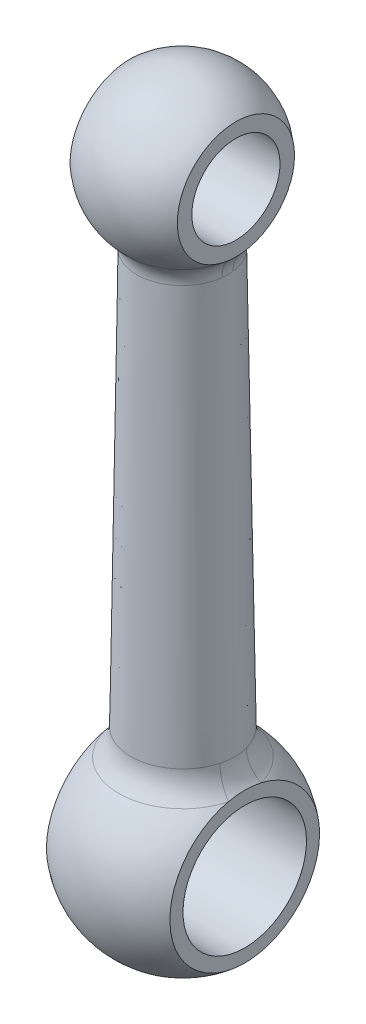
ISO-10303-21;
HEADER;
FILE_DESCRIPTION(('STEP AP214'),'2;1');
FILE_NAME('part.step','',(''),(''),'','','');
FILE_SCHEMA(('AUTOMOTIVE_DESIGN { 1 0 10303 214 1 1 1 1 }'));
ENDSEC;
DATA;
#1=APPLICATION_CONTEXT('core data for automotive mechanical design processes');
#2=APPLICATION_PROTOCOL_DEFINITION('international standard','automotive_design',2000,#1);
#3=PRODUCT_CONTEXT('',#1,'mechanical');
#4=PRODUCT('Part','Part','',(#3));
#5=PRODUCT_RELATED_PRODUCT_CATEGORY('part','',(#4));
#6=PRODUCT_DEFINITION_FORMATION('','',#4);
#7=PRODUCT_DEFINITION_CONTEXT('part definition',#1,'design');
#8=PRODUCT_DEFINITION('design','',#6,#7);
#9=PRODUCT_DEFINITION_SHAPE('','',#8);
#10=(LENGTH_UNIT() NAMED_UNIT(*) SI_UNIT(.MILLI.,.METRE.));
#11=(NAMED_UNIT(*) PLANE_ANGLE_UNIT() SI_UNIT($,.RADIAN.));
#12=(NAMED_UNIT(*) SI_UNIT($,.STERADIAN.) SOLID_ANGLE_UNIT());
#13=UNCERTAINTY_MEASURE_WITH_UNIT(LENGTH_MEASURE(1.E-05),#10,'distance_accuracy_value','');
#14=(GEOMETRIC_REPRESENTATION_CONTEXT(3) GLOBAL_UNCERTAINTY_ASSIGNED_CONTEXT((#13)) GLOBAL_UNIT_ASSIGNED_CONTEXT((#10,
#11,#12)) REPRESENTATION_CONTEXT('',''));
#15=CARTESIAN_POINT('',(0.,0.,0.));
#16=DIRECTION('',(0.,0.,1.));
#17=DIRECTION('',(1.,0.,0.));
#18=AXIS2_PLACEMENT_3D('',#15,#16,#17);
#19=CARTESIAN_POINT('',(0.,0.,0.));
#20=DIRECTION('',(0.00131599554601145,-0.999999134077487,0.));
#21=DIRECTION('',(-0.999999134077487,-0.00131599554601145,0.));
#22=AXIS2_PLACEMENT_3D('',#19,#20,#21);
#23=SPHERICAL_SURFACE('',#22,5.5);
#24=CARTESIAN_POINT('',(3.5,0.,0.));
#25=DIRECTION('',(-1.,0.,0.));
#26=DIRECTION('',(0.,-1.,0.));
#27=AXIS2_PLACEMENT_3D('',#24,#25,#26);
#28=CIRCLE('',#27,4.24264068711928);
#29=CARTESIAN_POINT('',(3.5,4.14066634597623,-0.924598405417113));
#30=VERTEX_POINT('',#29);
#31=CARTESIAN_POINT('',(3.5,4.14066634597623,0.924598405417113));
#32=VERTEX_POINT('',#31);
#33=EDGE_CURVE('E218',#30,#32,#28,.T.);
#34=ORIENTED_EDGE('',*,*,#33,.T.);
#35=CARTESIAN_POINT('',(-0.00544303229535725,4.1360531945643,0.));
#36=DIRECTION('',(0.00131599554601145,-0.999999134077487,0.));
#37=DIRECTION('',(0.999999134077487,0.00131599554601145,0.));
#38=AXIS2_PLACEMENT_3D('',#35,#36,#37);
#39=CIRCLE('',#38,3.62533230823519);
#40=CARTESIAN_POINT('',(-3.5,4.13145436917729,0.964927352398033));
#41=VERTEX_POINT('',#40);
#42=EDGE_CURVE('E213',#32,#41,#39,.T.);
#43=ORIENTED_EDGE('',*,*,#42,.T.);
#44=CARTESIAN_POINT('',(-3.5,0.,0.));
#45=DIRECTION('',(1.,0.,0.));
#46=DIRECTION('',(0.,1.,0.));
#47=AXIS2_PLACEMENT_3D('',#44,#45,#46);
#48=CIRCLE('',#47,4.24264068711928);
#49=CARTESIAN_POINT('',(-3.5,4.13145436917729,-0.964927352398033));
#50=VERTEX_POINT('',#49);
#51=EDGE_CURVE('E223',#41,#50,#48,.T.);
#52=ORIENTED_EDGE('',*,*,#51,.T.);
#53=CARTESIAN_POINT('',(-0.00544303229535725,4.1360531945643,0.));
#54=DIRECTION('',(0.00131599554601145,-0.999999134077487,0.));
#55=DIRECTION('',(0.999999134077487,0.00131599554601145,0.));
#56=AXIS2_PLACEMENT_3D('',#53,#54,#55);
#57=CIRCLE('',#56,3.62533230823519);
#58=EDGE_CURVE('E183',#50,#30,#57,.T.);
#59=ORIENTED_EDGE('',*,*,#58,.T.);
#60=EDGE_LOOP('',(#34,#43,#52,#59));
#61=FACE_BOUND('',#60,.T.);
#62=ADVANCED_FACE('F37',(#61),#23,.T.);
#63=CARTESIAN_POINT('',(-0.0392192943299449,29.8019704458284,0.));
#64=DIRECTION('',(0.00131599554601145,-0.999999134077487,0.));
#65=DIRECTION('',(0.999999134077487,0.00131599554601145,0.));
#66=AXIS2_PLACEMENT_3D('',#63,#64,#65);
#67=CONICAL_SURFACE('',#66,2.57,0.0154526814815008);
#68=CARTESIAN_POINT('',(3.5,4.07600137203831,-1.17737539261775));
#69=CARTESIAN_POINT('',(2.79591160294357,4.66353483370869,-0.949863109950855));
#70=CARTESIAN_POINT('',(2.77205655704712,5.60783818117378,-0.97035708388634));
#71=CARTESIAN_POINT('',(3.5,4.08778532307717,-1.13657782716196));
#72=CARTESIAN_POINT('',(2.80609372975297,4.67522410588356,-0.919056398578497));
#73=CARTESIAN_POINT('',(2.78463395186,5.60967811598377,-0.934239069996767));
#74=CARTESIAN_POINT('',(3.5,4.09909817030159,-1.09511695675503));
#75=CARTESIAN_POINT('',(2.81606850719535,4.68620732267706,-0.887300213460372));
#76=CARTESIAN_POINT('',(2.79651732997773,5.61094019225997,-0.897875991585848));
#77=CARTESIAN_POINT('',(3.5,4.12068895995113,-1.01085064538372));
#78=CARTESIAN_POINT('',(2.83535784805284,4.70672586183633,-0.822082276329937));
#79=CARTESIAN_POINT('',(2.8188865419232,5.61255219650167,-0.824673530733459));
#80=CARTESIAN_POINT('',(3.5,4.13096581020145,-0.968043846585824));
#81=CARTESIAN_POINT('',(2.84467692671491,4.71626788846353,-0.788615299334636));
#82=CARTESIAN_POINT('',(2.82937090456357,5.61290117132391,-0.787833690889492));
#83=CARTESIAN_POINT('',(3.5,4.16153927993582,-0.831115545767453));
#84=CARTESIAN_POINT('',(2.87261890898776,4.74401084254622,-0.680840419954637));
#85=CARTESIAN_POINT('',(2.86015595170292,5.61294299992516,-0.671114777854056));
#86=CARTESIAN_POINT('',(3.5,4.17974391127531,-0.734675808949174));
#87=CARTESIAN_POINT('',(2.8897510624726,4.75969468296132,-0.603402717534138));
#88=CARTESIAN_POINT('',(2.87785507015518,5.61141727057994,-0.590533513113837));
#89=CARTESIAN_POINT('',(3.5,4.20971489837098,-0.536929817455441));
#90=CARTESIAN_POINT('',(2.91816461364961,4.78465330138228,-0.442982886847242));
#91=CARTESIAN_POINT('',(2.90644846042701,5.60763211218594,-0.428142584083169));
#92=CARTESIAN_POINT('',(3.5,4.221477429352,-0.435620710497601));
#93=CARTESIAN_POINT('',(2.92950248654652,4.79398340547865,-0.359855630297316));
#94=CARTESIAN_POINT('',(2.9173386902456,5.60537224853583,-0.34633221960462));
#95=CARTESIAN_POINT('',(3.5,4.23766581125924,-0.229883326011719));
#96=CARTESIAN_POINT('',(2.94510955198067,4.80662193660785,-0.190398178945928));
#97=CARTESIAN_POINT('',(2.93221390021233,5.60200420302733,-0.181869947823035));
#98=CARTESIAN_POINT('',(3.5,4.2420737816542,-0.125448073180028));
#99=CARTESIAN_POINT('',(2.94940093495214,4.80994843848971,-0.103855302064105));
#100=CARTESIAN_POINT('',(2.9361820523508,5.60089883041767,-0.0992164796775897));
#101=CARTESIAN_POINT('',(3.5,4.24310438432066,0.0835972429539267));
#102=CARTESIAN_POINT('',(2.95039976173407,4.81073263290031,0.0691944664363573));
#103=CARTESIAN_POINT('',(2.93711545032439,5.60065308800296,0.0661187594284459));
#104=CARTESIAN_POINT('',(3.5,4.2397280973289,0.188207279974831));
#105=CARTESIAN_POINT('',(2.94711094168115,4.80819323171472,0.155933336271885));
#106=CARTESIAN_POINT('',(2.9340816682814,5.60151244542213,0.148800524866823));
#107=CARTESIAN_POINT('',(3.5,4.22550623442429,0.394722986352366));
#108=CARTESIAN_POINT('',(2.93338221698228,4.79715560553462,0.326237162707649));
#109=CARTESIAN_POINT('',(2.92105730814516,5.60457258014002,0.313478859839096));
#110=CARTESIAN_POINT('',(3.5,4.21467177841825,0.496632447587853));
#111=CARTESIAN_POINT('',(2.92291789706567,4.78863755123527,0.410017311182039));
#112=CARTESIAN_POINT('',(2.91107708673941,5.60677135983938,0.395476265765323));
#113=CARTESIAN_POINT('',(3.5,4.18640357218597,0.695815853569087));
#114=CARTESIAN_POINT('',(2.8960356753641,4.76533965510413,0.57204386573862));
#115=CARTESIAN_POINT('',(2.88427355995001,5.6107287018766,0.558337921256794));
#116=CARTESIAN_POINT('',(3.5,4.16897032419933,0.793090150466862));
#117=CARTESIAN_POINT('',(2.87955975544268,4.75050426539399,0.650442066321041));
#118=CARTESIAN_POINT('',(2.86745077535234,5.61248729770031,0.639202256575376));
#119=CARTESIAN_POINT('',(3.5,4.1286078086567,0.981789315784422));
#120=CARTESIAN_POINT('',(2.84238159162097,4.71425399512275,0.799926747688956));
#121=CARTESIAN_POINT('',(2.82712074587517,5.61320641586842,0.799213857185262));
#122=CARTESIAN_POINT('',(3.5,4.10568235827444,1.07321819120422));
#123=CARTESIAN_POINT('',(2.82162173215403,4.6927677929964,0.871095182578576));
#124=CARTESIAN_POINT('',(2.80361814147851,5.61216887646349,0.878362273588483));
#125=CARTESIAN_POINT('',(3.5,4.06796517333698,1.20572543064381));
#126=CARTESIAN_POINT('',(2.78889237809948,4.65558322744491,0.971472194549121));
#127=CARTESIAN_POINT('',(2.76352325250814,5.60669737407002,0.995374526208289));
#128=CARTESIAN_POINT('',(3.5,4.05483106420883,1.24914092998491));
#129=CARTESIAN_POINT('',(2.77767029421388,4.64230124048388,1.00398731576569));
#130=CARTESIAN_POINT('',(2.7493437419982,5.60421894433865,1.03411115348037));
#131=CARTESIAN_POINT('',(3.5,4.0275632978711,1.33444211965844));
#132=CARTESIAN_POINT('',(2.75493005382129,4.61406053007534,1.06692784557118));
#133=CARTESIAN_POINT('',(2.71940982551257,5.59766981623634,1.11093181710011));
#134=CARTESIAN_POINT('',(3.5,4.01342942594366,1.37632747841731));
#135=CARTESIAN_POINT('',(2.74340821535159,4.59909114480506,1.09734991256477));
#136=CARTESIAN_POINT('',(2.70365508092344,5.59359877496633,1.14901571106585));
#137=CARTESIAN_POINT('',(3.5,3.99885267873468,1.41745449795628));
#138=CARTESIAN_POINT('',(2.73190265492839,4.58332909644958,1.12663219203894));
#139=CARTESIAN_POINT('',(2.687134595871,5.58858919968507,1.18673022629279));
#140=(BOUNDED_SURFACE() B_SPLINE_SURFACE(3,2,((#68,#69,#70),(#71,#72,#73),(#74,#75,#76),(#77,
#78,#79),(#80,#81,#82),(#83,#84,#85),(#86,#87,#88),(#89,#90,#91),(#92,#93,#94),(#95,#96,#97),
(#98,#99,#100),(#101,#102,#103),(#104,#105,#106),(#107,#108,#109),(#110,#111,#112),(#113,#114,
#115),(#116,#117,#118),(#119,#120,#121),(#122,#123,#124),(#125,#126,#127),(#128,#129,#130),
(#131,#132,#133),(#134,#135,#136),(#137,#138,#139)),.UNSPECIFIED.,.F.,.F.,
.F.) B_SPLINE_SURFACE_WITH_KNOTS((4,2,2,2,2,2,2,2,2,2,2,4),(3,3),(0.,0.19272027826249,
0.38564164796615,0.800756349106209,1.2161172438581,1.63248650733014,2.04879796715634,
2.46449005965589,2.88015051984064,3.29552292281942,3.50340244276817,3.71132674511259),(0.,1.),
.UNSPECIFIED.) GEOMETRIC_REPRESENTATION_ITEM() RATIONAL_B_SPLINE_SURFACE(((1.,0.904181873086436,
1.),(1.,0.905934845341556,1.),(1.,0.907635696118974,1.),(1.,0.910908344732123,1.),(1.,
0.912480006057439,1.),(1.,0.917185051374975,1.),(1.,0.92003233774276,1.),(1.,0.924749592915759,
1.),(1.,0.926618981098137,1.),(1.,0.92919676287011,1.),(1.,0.929902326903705,1.),(1.,
0.930067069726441,1.),(1.,0.929526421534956,1.),(1.,0.927259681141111,1.),(1.,0.925535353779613,
1.),(1.,0.921076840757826,1.),(1.,0.918342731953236,1.),(1.,0.912107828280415,1.),(1.,
0.908607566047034,1.),(1.,0.902982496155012,1.),(1.,0.901044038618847,1.),(1.,0.897075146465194,
1.),(1.,0.895044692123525,1.),(1.,0.89298495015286,1.))) REPRESENTATION_ITEM('') SURFACE());
#141=CARTESIAN_POINT('',(2.687134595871,5.58858919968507,1.18673022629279));
#142=CARTESIAN_POINT('',(2.70365508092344,5.59359877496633,1.14901571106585));
#143=CARTESIAN_POINT('',(2.71940982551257,5.59766981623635,1.11093181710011));
#144=CARTESIAN_POINT('',(2.7493437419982,5.60421894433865,1.03411115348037));
#145=CARTESIAN_POINT('',(2.76352325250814,5.60669737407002,0.995374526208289));
#146=CARTESIAN_POINT('',(2.80361814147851,5.61216887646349,0.878362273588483));
#147=CARTESIAN_POINT('',(2.82712074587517,5.61320641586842,0.799213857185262));
#148=CARTESIAN_POINT('',(2.86745077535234,5.61248729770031,0.639202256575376));
#149=CARTESIAN_POINT('',(2.88427355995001,5.6107287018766,0.558337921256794));
#150=CARTESIAN_POINT('',(2.91107708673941,5.60677135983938,0.395476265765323));
#151=CARTESIAN_POINT('',(2.92105730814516,5.60457258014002,0.313478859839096));
#152=CARTESIAN_POINT('',(2.9340816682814,5.60151244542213,0.148800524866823));
#153=CARTESIAN_POINT('',(2.93711545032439,5.60065308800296,0.0661187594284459));
#154=CARTESIAN_POINT('',(2.9361820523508,5.60089883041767,-0.0992164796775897));
#155=CARTESIAN_POINT('',(2.93221390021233,5.60200420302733,-0.181869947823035));
#156=CARTESIAN_POINT('',(2.9173386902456,5.60537224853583,-0.34633221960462));
#157=CARTESIAN_POINT('',(2.90644846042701,5.60763211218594,-0.428142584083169));
#158=CARTESIAN_POINT('',(2.87785507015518,5.61141727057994,-0.590533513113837));
#159=CARTESIAN_POINT('',(2.86015595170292,5.61294299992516,-0.671114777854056));
#160=CARTESIAN_POINT('',(2.82937090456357,5.61290117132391,-0.787833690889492));
#161=CARTESIAN_POINT('',(2.8188865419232,5.61255219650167,-0.824673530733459));
#162=CARTESIAN_POINT('',(2.79651732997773,5.61094019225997,-0.897875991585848));
#163=CARTESIAN_POINT('',(2.78463395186,5.60967811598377,-0.934239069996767));
#164=CARTESIAN_POINT('',(2.77205655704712,5.60783818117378,-0.97035708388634));
#165=B_SPLINE_CURVE_WITH_KNOTS('',3,(#141,#142,#143,#144,#145,#146,#147,#148,#149,#150,#151,
#152,#153,#154,#155,#156,#157,#158,#159,#160,#161,#162,#163,#164),.UNSPECIFIED.,.F.,.F.,(4,2,2,
2,2,2,2,2,2,2,2,4),(0.,0.207924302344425,0.415803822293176,0.831176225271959,1.24683668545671,
1.66252877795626,2.07884023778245,2.4952095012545,2.91057039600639,3.32568509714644,
3.5186064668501,3.71132674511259),.UNSPECIFIED.);
#166=CARTESIAN_POINT('',(2.83913857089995,5.61291444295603,0.750800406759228));
#167=VERTEX_POINT('',#166);
#168=CARTESIAN_POINT('',(2.83913857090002,5.61291444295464,-0.750800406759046));
#169=VERTEX_POINT('',#168);
#170=EDGE_CURVE('E189',#167,#169,#165,.T.);
#171=ORIENTED_EDGE('',*,*,#170,.T.);
#172=CARTESIAN_POINT('',(-0.00738164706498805,5.60916843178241,0.));
#173=DIRECTION('',(0.00131599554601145,-0.999999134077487,0.));
#174=DIRECTION('',(0.999999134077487,0.00131599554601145,0.));
#175=AXIS2_PLACEMENT_3D('',#172,#173,#174);
#176=CIRCLE('',#175,2.94387374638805);
#177=CARTESIAN_POINT('',(-2.84506206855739,5.60543405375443,-0.783548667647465));
#178=VERTEX_POINT('',#177);
#179=EDGE_CURVE('E11',#169,#178,#176,.F.);
#180=ORIENTED_EDGE('',*,*,#179,.T.);
#181=CARTESIAN_POINT('',(-3.5,4.06824583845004,1.20390024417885));
#182=CARTESIAN_POINT('',(-2.80071343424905,4.65759850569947,0.971541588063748));
#183=CARTESIAN_POINT('',(-2.77916146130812,5.60070332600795,0.991977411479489));
#184=CARTESIAN_POINT('',(-3.5,4.07966872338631,1.16529738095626));
#185=CARTESIAN_POINT('',(-2.81059673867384,4.66888847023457,0.942464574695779));
#186=CARTESIAN_POINT('',(-2.79140909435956,5.60243337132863,0.957681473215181));
#187=CARTESIAN_POINT('',(-3.5,4.09067482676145,1.12608741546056));
#188=CARTESIAN_POINT('',(-2.82030805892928,4.67954024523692,0.912518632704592));
#189=CARTESIAN_POINT('',(-2.80302832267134,5.60362201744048,0.923158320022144));
#190=CARTESIAN_POINT('',(-3.5,4.1117749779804,1.04642661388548));
#191=CARTESIAN_POINT('',(-2.83917007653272,4.69953317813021,0.851048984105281));
#192=CARTESIAN_POINT('',(-2.82500259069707,5.60512908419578,0.853667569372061));
#193=CARTESIAN_POINT('',(-3.5,4.1218681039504,1.00597457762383));
#194=CARTESIAN_POINT('',(-2.84832457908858,4.70888016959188,0.819521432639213));
#195=CARTESIAN_POINT('',(-2.83535635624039,5.6054466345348,0.818699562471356));
#196=CARTESIAN_POINT('',(-3.5,4.15310179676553,0.872235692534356));
#197=CARTESIAN_POINT('',(-2.8768749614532,4.73714232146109,0.714596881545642));
#198=CARTESIAN_POINT('',(-2.86697922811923,5.60540564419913,0.704171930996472));
#199=CARTESIAN_POINT('',(-3.5,4.17216457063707,0.776508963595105));
#200=CARTESIAN_POINT('',(-2.89483658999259,4.75348451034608,0.637906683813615));
#201=CARTESIAN_POINT('',(-2.88559174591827,5.60369378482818,0.623862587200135));
#202=CARTESIAN_POINT('',(-3.5,4.20399971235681,0.579909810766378));
#203=CARTESIAN_POINT('',(-2.92507827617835,4.77977899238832,0.478648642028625));
#204=CARTESIAN_POINT('',(-2.91603806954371,5.59935274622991,0.461940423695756));
#205=CARTESIAN_POINT('',(-3.5,4.21676814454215,0.479034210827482));
#206=CARTESIAN_POINT('',(-2.9374167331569,4.78978901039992,0.395944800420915));
#207=CARTESIAN_POINT('',(-2.92786763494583,5.59672299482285,0.380326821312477));
#208=CARTESIAN_POINT('',(-3.5,4.2350532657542,0.273770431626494));
#209=CARTESIAN_POINT('',(-2.95509971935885,4.80384537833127,0.226909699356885));
#210=CARTESIAN_POINT('',(-2.94464718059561,5.59258999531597,0.216170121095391));
#211=CARTESIAN_POINT('',(-3.5,4.24055171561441,0.169374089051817));
#212=CARTESIAN_POINT('',(-2.96047078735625,4.8079130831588,0.140369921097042));
#213=CARTESIAN_POINT('',(-2.94957985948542,5.59108958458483,0.133625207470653));
#214=CARTESIAN_POINT('',(-3.5,4.2437432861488,-0.0399974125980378));
#215=CARTESIAN_POINT('',(-2.96357641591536,4.81028606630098,-0.0331098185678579));
#216=CARTESIAN_POINT('',(-2.95245503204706,5.59024575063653,-0.0315756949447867));
#217=CARTESIAN_POINT('',(-3.5,4.24143779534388,-0.144972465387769));
#218=CARTESIAN_POINT('',(-2.9613207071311,4.80859872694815,-0.120282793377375));
#219=CARTESIAN_POINT('',(-2.95039876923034,5.59090194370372,-0.114231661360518));
#220=CARTESIAN_POINT('',(-3.5,4.22924760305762,-0.352510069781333));
#221=CARTESIAN_POINT('',(-2.94948825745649,4.79940568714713,-0.291812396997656));
#222=CARTESIAN_POINT('',(-2.93933106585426,5.59392899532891,-0.278923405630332));
#223=CARTESIAN_POINT('',(-3.5,4.21937555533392,-0.455076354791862));
#224=CARTESIAN_POINT('',(-2.93989296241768,4.79188551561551,-0.376391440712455));
#225=CARTESIAN_POINT('',(-2.93033123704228,5.59629699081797,-0.360959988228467));
#226=CARTESIAN_POINT('',(-3.5,4.19288225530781,-0.655742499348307));
#227=CARTESIAN_POINT('',(-2.91449437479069,4.77071950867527,-0.540288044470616));
#228=CARTESIAN_POINT('',(-2.90548118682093,5.60104539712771,-0.523981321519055));
#229=CARTESIAN_POINT('',(-3.5,4.17626111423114,-0.75384243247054));
#230=CARTESIAN_POINT('',(-2.8986340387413,4.75702180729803,-0.619767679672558));
#231=CARTESIAN_POINT('',(-2.8896310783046,5.60342580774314,-0.604966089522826));
#232=CARTESIAN_POINT('',(-3.5,4.13737356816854,-0.94423835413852));
#233=CARTESIAN_POINT('',(-2.86237519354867,4.72313766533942,-0.771583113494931));
#234=CARTESIAN_POINT('',(-2.85122246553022,5.60583323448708,-0.765311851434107));
#235=CARTESIAN_POINT('',(-3.5,4.11511052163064,-1.03653775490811));
#236=CARTESIAN_POINT('',(-2.84191702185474,4.70288189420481,-0.844010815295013));
#237=CARTESIAN_POINT('',(-2.8286679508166,5.60586164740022,-0.844673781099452));
#238=CARTESIAN_POINT('',(-3.5,4.07829763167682,-1.17031315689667));
#239=CARTESIAN_POINT('',(-2.80938664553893,4.66756054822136,-0.946319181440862));
#240=CARTESIAN_POINT('',(-2.78996199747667,5.60228479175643,-0.962079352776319));
#241=CARTESIAN_POINT('',(-3.5,4.06545133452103,-1.21414200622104));
#242=CARTESIAN_POINT('',(-2.79818954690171,4.65490671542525,-0.979485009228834));
#243=CARTESIAN_POINT('',(-2.77624141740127,5.60048786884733,-1.00095633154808));
#244=CARTESIAN_POINT('',(-3.5,4.03873353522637,-1.30025406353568));
#245=CARTESIAN_POINT('',(-2.77541418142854,4.62792184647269,-1.04373269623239));
#246=CARTESIAN_POINT('',(-2.74721012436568,5.59539354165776,-1.0780863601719));
#247=CARTESIAN_POINT('',(-3.5,4.02486182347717,-1.34253695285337));
#248=CARTESIAN_POINT('',(-2.76383162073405,4.61358009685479,-1.07481216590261));
#249=CARTESIAN_POINT('',(-2.73189908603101,5.59209582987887,-1.11633928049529));
#250=CARTESIAN_POINT('',(-3.5,4.01053648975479,-1.38405096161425));
#251=CARTESIAN_POINT('',(-2.75222253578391,4.59843921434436,-1.10474736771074));
#252=CARTESIAN_POINT('',(-2.71581253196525,5.58790178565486,-1.15423856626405));
#253=(BOUNDED_SURFACE() B_SPLINE_SURFACE(3,2,((#181,#182,#183),(#184,#185,#186),(#187,#188,
#189),(#190,#191,#192),(#193,#194,#195),(#196,#197,#198),(#199,#200,#201),(#202,#203,#204),
(#205,#206,#207),(#208,#209,#210),(#211,#212,#213),(#214,#215,#216),(#217,#218,#219),(#220,#221,
#222),(#223,#224,#225),(#226,#227,#228),(#229,#230,#231),(#232,#233,#234),(#235,#236,#237),
(#238,#239,#240),(#241,#242,#243),(#244,#245,#246),(#247,#248,#249),(#250,#251,#252)),
.UNSPECIFIED.,.F.,.F.,.F.) B_SPLINE_SURFACE_WITH_KNOTS((4,2,2,2,2,2,2,2,2,2,2,4),(3,3),(0.,
0.183503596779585,0.367190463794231,0.781986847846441,1.19704226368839,1.61313702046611,
2.0291577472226,2.44448426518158,2.8598039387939,3.27487696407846,3.48257372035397,
3.69031305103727),(0.,1.),
.UNSPECIFIED.) GEOMETRIC_REPRESENTATION_ITEM() RATIONAL_B_SPLINE_SURFACE(((1.,0.904400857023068,
1.),(1.,0.906100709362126,1.),(1.,0.907755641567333,1.),(1.,0.910954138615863,1.),(1.,
0.912497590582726,1.),(1.,0.917304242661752,1.),(1.,0.920287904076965,1.),(1.,0.92530503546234,
1.),(1.,0.927337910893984,1.),(1.,0.93025604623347,1.),(1.,0.931138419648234,1.),(1.,
0.931650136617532,1.),(1.,0.931279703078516,1.),(1.,0.929328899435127,1.),(1.,0.92775054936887,
1.),(1.,0.923548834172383,1.),(1.,0.920925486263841,1.),(1.,0.914872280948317,1.),(1.,
0.911442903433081,1.),(1.,0.905894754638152,1.),(1.,0.903977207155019,1.),(1.,0.900040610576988,
1.),(1.,0.898021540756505,1.),(1.,0.895968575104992,1.))) REPRESENTATION_ITEM('') SURFACE());
#254=CARTESIAN_POINT('',(-2.71581253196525,5.58790178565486,-1.15423856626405));
#255=CARTESIAN_POINT('',(-2.73189908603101,5.59209582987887,-1.11633928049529));
#256=CARTESIAN_POINT('',(-2.74721012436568,5.59539354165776,-1.0780863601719));
#257=CARTESIAN_POINT('',(-2.77624141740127,5.60048786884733,-1.00095633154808));
#258=CARTESIAN_POINT('',(-2.78996199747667,5.60228479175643,-0.962079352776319));
#259=CARTESIAN_POINT('',(-2.8286679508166,5.60586164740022,-0.844673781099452));
#260=CARTESIAN_POINT('',(-2.85122246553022,5.60583323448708,-0.765311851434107));
#261=CARTESIAN_POINT('',(-2.8896310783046,5.60342580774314,-0.604966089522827));
#262=CARTESIAN_POINT('',(-2.90548118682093,5.60104539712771,-0.523981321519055));
#263=CARTESIAN_POINT('',(-2.93033123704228,5.59629699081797,-0.360959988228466));
#264=CARTESIAN_POINT('',(-2.93933106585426,5.59392899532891,-0.278923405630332));
#265=CARTESIAN_POINT('',(-2.95039876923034,5.59090194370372,-0.114231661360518));
#266=CARTESIAN_POINT('',(-2.95245503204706,5.59024575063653,-0.0315756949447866));
#267=CARTESIAN_POINT('',(-2.94957985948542,5.59108958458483,0.133625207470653));
#268=CARTESIAN_POINT('',(-2.94464718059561,5.59258999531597,0.216170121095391));
#269=CARTESIAN_POINT('',(-2.92786763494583,5.59672299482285,0.380326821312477));
#270=CARTESIAN_POINT('',(-2.91603806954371,5.59935274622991,0.461940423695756));
#271=CARTESIAN_POINT('',(-2.88559174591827,5.60369378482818,0.623862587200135));
#272=CARTESIAN_POINT('',(-2.86697922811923,5.60540564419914,0.704171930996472));
#273=CARTESIAN_POINT('',(-2.83535635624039,5.6054466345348,0.818699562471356));
#274=CARTESIAN_POINT('',(-2.82500259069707,5.60512908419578,0.853667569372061));
#275=CARTESIAN_POINT('',(-2.80302832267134,5.60362201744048,0.923158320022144));
#276=CARTESIAN_POINT('',(-2.79140909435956,5.60243337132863,0.957681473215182));
#277=CARTESIAN_POINT('',(-2.77916146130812,5.60070332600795,0.991977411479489));
#278=B_SPLINE_CURVE_WITH_KNOTS('',3,(#254,#255,#256,#257,#258,#259,#260,#261,#262,#263,#264,
#265,#266,#267,#268,#269,#270,#271,#272,#273,#274,#275,#276,#277),.UNSPECIFIED.,.F.,.F.,(4,2,2,
2,2,2,2,2,2,2,2,4),(0.,0.207739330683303,0.415436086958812,0.830509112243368,1.24582878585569,
1.66115530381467,2.07717603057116,2.49327078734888,2.90832620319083,3.32312258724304,
3.50680945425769,3.69031305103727),.UNSPECIFIED.);
#279=CARTESIAN_POINT('',(-2.84506206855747,5.60543405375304,0.783548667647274));
#280=VERTEX_POINT('',#279);
#281=EDGE_CURVE('E49',#178,#280,#278,.T.);
#282=ORIENTED_EDGE('',*,*,#281,.T.);
#283=CARTESIAN_POINT('',(-0.00738164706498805,5.60916843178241,0.));
#284=DIRECTION('',(0.00131599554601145,-0.999999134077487,0.));
#285=DIRECTION('',(0.999999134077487,0.00131599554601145,0.));
#286=AXIS2_PLACEMENT_3D('',#283,#284,#285);
#287=CIRCLE('',#286,2.94387374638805);
#288=EDGE_CURVE('E187',#280,#167,#287,.F.);
#289=ORIENTED_EDGE('',*,*,#288,.T.);
#290=EDGE_LOOP('',(#171,#180,#282,#289));
#291=FACE_BOUND('',#290,.T.);
#292=CARTESIAN_POINT('',(-0.0382600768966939,29.0730799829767,0.));
#293=DIRECTION('',(0.00131599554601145,-0.999999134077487,0.));
#294=DIRECTION('',(0.999999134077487,0.00131599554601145,0.));
#295=AXIS2_PLACEMENT_3D('',#292,#293,#294);
#296=CIRCLE('',#295,2.58126421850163);
#297=CARTESIAN_POINT('',(-2.53351816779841,29.0697962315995,-0.660758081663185));
#298=VERTEX_POINT('',#297);
#299=CARTESIAN_POINT('',(2.52399217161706,29.0764518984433,-0.312693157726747));
#300=VERTEX_POINT('',#299);
#301=EDGE_CURVE('E318',#298,#300,#296,.T.);
#302=ORIENTED_EDGE('',*,*,#301,.T.);
#303=CARTESIAN_POINT('',(2.45629983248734,29.0828840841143,-0.662964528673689));
#304=CARTESIAN_POINT('',(2.45011445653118,29.811308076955,-0.638803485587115));
#305=CARTESIAN_POINT('',(3.,30.2710530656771,-0.771030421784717));
#306=CARTESIAN_POINT('',(2.47168852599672,29.0800855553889,-0.60525972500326));
#307=CARTESIAN_POINT('',(2.46339058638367,29.7962455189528,-0.588075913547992));
#308=CARTESIAN_POINT('',(3.,30.255803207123,-0.707127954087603));
#309=CARTESIAN_POINT('',(2.48504982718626,29.0784715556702,-0.547006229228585));
#310=CARTESIAN_POINT('',(2.47555282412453,29.7832455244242,-0.534811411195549));
#311=CARTESIAN_POINT('',(3.,30.2421764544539,-0.64144601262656));
#312=CARTESIAN_POINT('',(2.50759504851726,29.0766557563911,-0.430144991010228));
#313=CARTESIAN_POINT('',(2.49668165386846,29.7614947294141,-0.42528242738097));
#314=CARTESIAN_POINT('',(3.,30.2187548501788,-0.50780630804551));
#315=CARTESIAN_POINT('',(2.51680993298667,29.0764433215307,-0.371543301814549));
#316=CARTESIAN_POINT('',(2.50570283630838,29.7526756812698,-0.368980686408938));
#317=CARTESIAN_POINT('',(3.,30.2089316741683,-0.439869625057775));
#318=CARTESIAN_POINT('',(2.53176397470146,29.0764611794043,-0.249012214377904));
#319=CARTESIAN_POINT('',(2.52054490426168,29.738472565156,-0.249363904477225));
#320=CARTESIAN_POINT('',(3.,30.1928212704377,-0.296350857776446));
#321=CARTESIAN_POINT('',(2.53715573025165,29.076729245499,-0.185040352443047));
#322=CARTESIAN_POINT('',(2.52607549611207,29.7333966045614,-0.185718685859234));
#323=CARTESIAN_POINT('',(3.,30.1868904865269,-0.220598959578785));
#324=CARTESIAN_POINT('',(2.54316410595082,29.0770516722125,-0.0568493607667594));
#325=CARTESIAN_POINT('',(2.53224196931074,29.7277554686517,-0.0573473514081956));
#326=CARTESIAN_POINT('',(3.,30.1802683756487,-0.0679848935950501));
#327=CARTESIAN_POINT('',(2.54377893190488,29.0771059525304,0.00736985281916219));
#328=CARTESIAN_POINT('',(2.53289024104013,29.7271789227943,0.00752543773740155));
#329=CARTESIAN_POINT('',(3.,30.179579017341,0.00887768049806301));
#330=CARTESIAN_POINT('',(2.54019595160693,29.0768796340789,0.136736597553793));
#331=CARTESIAN_POINT('',(2.52918900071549,29.7305376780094,0.137433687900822));
#332=CARTESIAN_POINT('',(3.,30.1835427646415,0.163176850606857));
#333=CARTESIAN_POINT('',(2.53591847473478,29.0765934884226,0.201881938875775));
#334=CARTESIAN_POINT('',(2.5247477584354,29.7345558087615,0.202609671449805));
#335=CARTESIAN_POINT('',(3.,30.1882843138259,0.240601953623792));
#336=CARTESIAN_POINT('',(2.52244128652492,29.076409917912,0.331641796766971));
#337=CARTESIAN_POINT('',(2.51127318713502,29.747311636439,0.330364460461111));
#338=CARTESIAN_POINT('',(3.,30.2028846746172,0.393378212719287));
#339=CARTESIAN_POINT('',(2.51324302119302,29.0765123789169,0.396256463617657));
#340=CARTESIAN_POINT('',(2.50221151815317,29.7560772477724,0.393077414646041));
#341=CARTESIAN_POINT('',(3.,30.2127419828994,0.468729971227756));
#342=CARTESIAN_POINT('',(2.50159329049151,29.0771751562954,0.460427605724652));
#343=CARTESIAN_POINT('',(2.4911128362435,29.7672616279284,0.453442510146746));
#344=CARTESIAN_POINT('',(3.,30.2249739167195,0.542387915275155));
#345=(BOUNDED_SURFACE() B_SPLINE_SURFACE(3,2,((#303,#304,#305),(#306,#307,#308),(#309,#310,
#311),(#312,#313,#314),(#315,#316,#317),(#318,#319,#320),(#321,#322,#323),(#324,#325,#326),
(#327,#328,#329),(#330,#331,#332),(#333,#334,#335),(#336,#337,#338),(#339,#340,#341),(#342,#343,
#344)),.UNSPECIFIED.,.F.,.F.,.F.) B_SPLINE_SURFACE_WITH_KNOTS((4,2,2,2,2,2,4),(3,3),(0.,
0.283293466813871,0.564434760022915,0.868653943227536,1.17298738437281,1.48234829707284,
1.79161835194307),(0.,1.),
.UNSPECIFIED.) GEOMETRIC_REPRESENTATION_ITEM() RATIONAL_B_SPLINE_SURFACE(((1.,0.899442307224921,
1.),(1.,0.902386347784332,1.),(1.,0.9050514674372,1.),(1.,0.909668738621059,1.),(1.,
0.911626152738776,1.),(1.,0.914848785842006,1.),(1.,0.916043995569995,1.),(1.,0.917379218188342,
1.),(1.,0.917518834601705,1.),(1.,0.916718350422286,1.),(1.,0.915760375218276,1.),(1.,
0.912834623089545,1.),(1.,0.910867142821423,1.),(1.,0.908444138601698,1.))) REPRESENTATION_ITEM('') SURFACE());
#346=CARTESIAN_POINT('',(2.45629983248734,29.0828840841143,-0.662964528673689));
#347=CARTESIAN_POINT('',(2.47168852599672,29.0800855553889,-0.60525972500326));
#348=CARTESIAN_POINT('',(2.48504982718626,29.0784715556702,-0.547006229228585));
#349=CARTESIAN_POINT('',(2.50759504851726,29.0766557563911,-0.430144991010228));
#350=CARTESIAN_POINT('',(2.51680993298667,29.0764433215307,-0.371543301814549));
#351=CARTESIAN_POINT('',(2.53176397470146,29.0764611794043,-0.249012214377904));
#352=CARTESIAN_POINT('',(2.53715573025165,29.076729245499,-0.185040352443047));
#353=CARTESIAN_POINT('',(2.54316410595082,29.0770516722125,-0.0568493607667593));
#354=CARTESIAN_POINT('',(2.54377893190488,29.0771059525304,0.00736985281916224));
#355=CARTESIAN_POINT('',(2.54019595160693,29.0768796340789,0.136736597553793));
#356=CARTESIAN_POINT('',(2.53591847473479,29.0765934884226,0.201881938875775));
#357=CARTESIAN_POINT('',(2.52244128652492,29.076409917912,0.331641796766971));
#358=CARTESIAN_POINT('',(2.51324302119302,29.0765123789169,0.396256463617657));
#359=CARTESIAN_POINT('',(2.50159329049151,29.0771751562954,0.460427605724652));
#360=B_SPLINE_CURVE_WITH_KNOTS('',3,(#346,#347,#348,#349,#350,#351,#352,#353,#354,#355,#356,
#357,#358,#359),.UNSPECIFIED.,.F.,.F.,(4,2,2,2,2,2,4),(0.,0.283293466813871,0.564434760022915,
0.868653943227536,1.17298738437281,1.48234829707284,1.79161835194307),.UNSPECIFIED.);
#361=CARTESIAN_POINT('',(2.52399217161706,29.0764518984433,0.312693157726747));
#362=VERTEX_POINT('',#361);
#363=EDGE_CURVE('E321',#300,#362,#360,.T.);
#364=ORIENTED_EDGE('',*,*,#363,.T.);
#365=CARTESIAN_POINT('',(-0.0382600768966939,29.0730799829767,0.));
#366=DIRECTION('',(0.00131599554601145,-0.999999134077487,0.));
#367=DIRECTION('',(0.999999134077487,0.00131599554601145,0.));
#368=AXIS2_PLACEMENT_3D('',#365,#366,#367);
#369=CIRCLE('',#368,2.58126421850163);
#370=CARTESIAN_POINT('',(-2.53351816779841,29.0697962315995,0.660758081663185));
#371=VERTEX_POINT('',#370);
#372=EDGE_CURVE('E334',#362,#371,#369,.T.);
#373=ORIENTED_EDGE('',*,*,#372,.T.);
#374=CARTESIAN_POINT('',(-2.37887271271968,29.1001711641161,1.0873025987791));
#375=CARTESIAN_POINT('',(-2.40118124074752,29.8823687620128,1.01280329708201));
#376=CARTESIAN_POINT('',(-3.,30.3367407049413,1.2426796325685));
#377=CARTESIAN_POINT('',(-2.39484848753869,29.0943159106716,1.05311228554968));
#378=CARTESIAN_POINT('',(-2.41197925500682,29.8671544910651,0.98742535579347));
#379=CARTESIAN_POINT('',(-3.,30.3228884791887,1.20734711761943));
#380=CARTESIAN_POINT('',(-2.41008127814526,29.0894833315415,1.01851641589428));
#381=CARTESIAN_POINT('',(-2.42285448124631,29.8527125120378,0.960921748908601));
#382=CARTESIAN_POINT('',(-3.,30.3094383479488,1.17131509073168));
#383=CARTESIAN_POINT('',(-2.43901156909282,29.0815820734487,0.948620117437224));
#384=CARTESIAN_POINT('',(-2.44440673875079,29.8255098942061,0.905837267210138));
#385=CARTESIAN_POINT('',(-3.,30.2834512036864,1.09781268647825));
#386=CARTESIAN_POINT('',(-2.45270956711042,29.0785128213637,0.913319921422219));
#387=CARTESIAN_POINT('',(-2.45508718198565,29.812736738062,0.877262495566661));
#388=CARTESIAN_POINT('',(-3.,30.2709138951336,1.06034278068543));
#389=CARTESIAN_POINT('',(-2.49143832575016,29.0715243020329,0.806499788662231));
#390=CARTESIAN_POINT('',(-2.48634686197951,29.7770532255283,0.78867535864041));
#391=CARTESIAN_POINT('',(-3.,30.2348250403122,0.945693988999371));
#392=CARTESIAN_POINT('',(-2.51410881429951,29.0698226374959,0.734049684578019));
#393=CARTESIAN_POINT('',(-2.50634158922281,29.7565181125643,0.725345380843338));
#394=CARTESIAN_POINT('',(-3.,30.2127922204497,0.86626514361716));
#395=CARTESIAN_POINT('',(-2.55057587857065,29.0697730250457,0.596346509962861));
#396=CARTESIAN_POINT('',(-2.54013556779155,29.7241420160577,0.59951459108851));
#397=CARTESIAN_POINT('',(-3.,30.1761899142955,0.711540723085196));
#398=CARTESIAN_POINT('',(-2.56511482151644,29.0710437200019,0.531284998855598));
#399=CARTESIAN_POINT('',(-2.55442733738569,29.711498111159,0.537848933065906));
#400=CARTESIAN_POINT('',(-3.,30.1610396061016,0.636910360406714));
#401=CARTESIAN_POINT('',(-2.58910659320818,29.0743717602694,0.400239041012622));
#402=CARTESIAN_POINT('',(-2.57865696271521,29.690998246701,0.410242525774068));
#403=CARTESIAN_POINT('',(-3.,30.1355052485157,0.483918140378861));
#404=CARTESIAN_POINT('',(-2.59855959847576,29.0764290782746,0.334254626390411));
#405=CARTESIAN_POINT('',(-2.58864390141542,29.6830945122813,0.344197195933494));
#406=CARTESIAN_POINT('',(-3.,30.1251210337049,0.405556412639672));
#407=CARTESIAN_POINT('',(-2.6123578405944,29.0798143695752,0.201617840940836));
#408=CARTESIAN_POINT('',(-2.60338986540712,29.6716872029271,0.209283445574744));
#409=CARTESIAN_POINT('',(-3.,30.1097918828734,0.246035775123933));
#410=CARTESIAN_POINT('',(-2.61669315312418,29.0811409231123,0.134964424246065));
#411=CARTESIAN_POINT('',(-2.60817438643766,29.6681633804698,0.140256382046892));
#412=CARTESIAN_POINT('',(-3.,30.1048575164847,0.164871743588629));
#413=CARTESIAN_POINT('',(-2.62020755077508,29.0821927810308,0.00152027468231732));
#414=CARTESIAN_POINT('',(-2.61203314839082,29.6653045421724,0.00166747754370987));
#415=CARTESIAN_POINT('',(-3.,30.1008618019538,0.00189652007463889));
#416=CARTESIAN_POINT('',(-2.61938689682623,29.0819181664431,-0.0652704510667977));
#417=CARTESIAN_POINT('',(-2.61111780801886,29.6659618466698,-0.0680753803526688));
#418=CARTESIAN_POINT('',(-3.,30.1018001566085,-0.0799146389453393));
#419=CARTESIAN_POINT('',(-2.61231074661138,29.0798705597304,-0.204093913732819));
#420=CARTESIAN_POINT('',(-2.60338840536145,29.6717316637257,-0.211664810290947));
#421=CARTESIAN_POINT('',(-3.,30.1098041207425,-0.248915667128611));
#422=CARTESIAN_POINT('',(-2.60561164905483,29.0779755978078,-0.276103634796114));
#423=CARTESIAN_POINT('',(-2.59606985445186,29.6772253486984,-0.285577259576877));
#424=CARTESIAN_POINT('',(-3.,30.1173697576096,-0.335991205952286));
#425=CARTESIAN_POINT('',(-2.5862030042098,29.0739471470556,-0.419303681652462));
#426=CARTESIAN_POINT('',(-2.57571892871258,29.6934712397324,-0.429107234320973));
#427=CARTESIAN_POINT('',(-3.,30.1386189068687,-0.506455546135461));
#428=CARTESIAN_POINT('',(-2.57349343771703,29.0718136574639,-0.490494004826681));
#429=CARTESIAN_POINT('',(-2.56263206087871,29.7042702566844,-0.498897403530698));
#430=CARTESIAN_POINT('',(-3.,30.1523024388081,-0.589844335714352));
#431=CARTESIAN_POINT('',(-2.54209304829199,29.0695075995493,-0.631648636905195));
#432=CARTESIAN_POINT('',(-2.53212003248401,29.7315936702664,-0.63241173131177));
#433=CARTESIAN_POINT('',(-3.,30.1848113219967,-0.75167225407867));
#434=CARTESIAN_POINT('',(-2.52339623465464,29.0693370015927,-0.701611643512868));
#435=CARTESIAN_POINT('',(-2.51462686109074,29.7481941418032,-0.696227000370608));
#436=CARTESIAN_POINT('',(-3.,30.2036418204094,-0.830106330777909));
#437=CARTESIAN_POINT('',(-2.48015077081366,29.073211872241,-0.839700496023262));
#438=CARTESIAN_POINT('',(-2.47701064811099,29.7873663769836,-0.816922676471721));
#439=CARTESIAN_POINT('',(-3.,30.2455020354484,-0.981726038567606));
#440=CARTESIAN_POINT('',(-2.45559789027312,29.0772603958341,-0.907824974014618));
#441=CARTESIAN_POINT('',(-2.45683384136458,29.8100261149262,-0.873823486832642));
#442=CARTESIAN_POINT('',(-3.,30.2685347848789,-1.05490782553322));
#443=CARTESIAN_POINT('',(-2.4281935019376,29.0845460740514,-0.974709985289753));
#444=CARTESIAN_POINT('',(-2.43637314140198,29.835665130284,-0.926340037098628));
#445=CARTESIAN_POINT('',(-3.,30.2931856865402,-1.12530259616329));
#446=(BOUNDED_SURFACE() B_SPLINE_SURFACE(3,2,((#374,#375,#376),(#377,#378,#379),(#380,#381,
#382),(#383,#384,#385),(#386,#387,#388),(#389,#390,#391),(#392,#393,#394),(#395,#396,#397),
(#398,#399,#400),(#401,#402,#403),(#404,#405,#406),(#407,#408,#409),(#410,#411,#412),(#413,#414,
#415),(#416,#417,#418),(#419,#420,#421),(#422,#423,#424),(#425,#426,#427),(#428,#429,#430),
(#431,#432,#433),(#434,#435,#436),(#437,#438,#439),(#440,#441,#442),(#443,#444,#445)),
.UNSPECIFIED.,.F.,.F.,.F.) B_SPLINE_SURFACE_WITH_KNOTS((4,2,2,2,2,2,2,2,2,2,2,4),(3,3),(0.,
0.179824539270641,0.359590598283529,0.719067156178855,1.03498943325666,1.35090074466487,
1.66742367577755,1.98393058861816,2.32659784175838,2.66926618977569,3.01227848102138,
3.3555393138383),(0.,1.),
.UNSPECIFIED.) GEOMETRIC_REPRESENTATION_ITEM() RATIONAL_B_SPLINE_SURFACE(((1.,0.885749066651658,
1.),(1.,0.888256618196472,1.),(1.,0.89073674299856,1.),(1.,0.895599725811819,1.),(1.,
0.897982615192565,1.),(1.,0.904923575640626,1.),(1.,0.909274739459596,1.),(1.,0.916596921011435,
1.),(1.,0.919671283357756,1.),(1.,0.924884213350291,1.),(1.,0.927022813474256,1.),(1.,
0.930188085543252,1.),(1.,0.931212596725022,1.),(1.,0.932040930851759,1.),(1.,0.931844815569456,
1.),(1.,0.930186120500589,1.),(1.,0.928620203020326,1.),(1.,0.924249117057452,1.),(1.,
0.92144394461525,1.),(1.,0.914862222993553,1.),(1.,0.911084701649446,1.),(1.,0.902858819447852,
1.),(1.,0.898409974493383,1.),(1.,0.893778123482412,1.))) REPRESENTATION_ITEM('') SURFACE());
#447=CARTESIAN_POINT('',(-2.37887271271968,29.1001711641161,1.0873025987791));
#448=CARTESIAN_POINT('',(-2.39484848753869,29.0943159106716,1.05311228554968));
#449=CARTESIAN_POINT('',(-2.41008127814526,29.0894833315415,1.01851641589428));
#450=CARTESIAN_POINT('',(-2.43901156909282,29.0815820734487,0.948620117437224));
#451=CARTESIAN_POINT('',(-2.45270956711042,29.0785128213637,0.913319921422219));
#452=CARTESIAN_POINT('',(-2.49143832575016,29.0715243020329,0.806499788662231));
#453=CARTESIAN_POINT('',(-2.51410881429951,29.0698226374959,0.734049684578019));
#454=CARTESIAN_POINT('',(-2.55057587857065,29.0697730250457,0.596346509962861));
#455=CARTESIAN_POINT('',(-2.56511482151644,29.0710437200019,0.531284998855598));
#456=CARTESIAN_POINT('',(-2.58910659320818,29.0743717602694,0.400239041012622));
#457=CARTESIAN_POINT('',(-2.59855959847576,29.0764290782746,0.334254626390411));
#458=CARTESIAN_POINT('',(-2.6123578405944,29.0798143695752,0.201617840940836));
#459=CARTESIAN_POINT('',(-2.61669315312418,29.0811409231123,0.134964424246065));
#460=CARTESIAN_POINT('',(-2.62020755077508,29.0821927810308,0.00152027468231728));
#461=CARTESIAN_POINT('',(-2.61938689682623,29.0819181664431,-0.0652704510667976));
#462=CARTESIAN_POINT('',(-2.61231074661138,29.0798705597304,-0.204093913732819));
#463=CARTESIAN_POINT('',(-2.60561164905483,29.0779755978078,-0.276103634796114));
#464=CARTESIAN_POINT('',(-2.5862030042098,29.0739471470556,-0.419303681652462));
#465=CARTESIAN_POINT('',(-2.57349343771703,29.0718136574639,-0.490494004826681));
#466=CARTESIAN_POINT('',(-2.54209304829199,29.0695075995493,-0.631648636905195));
#467=CARTESIAN_POINT('',(-2.52339623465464,29.0693370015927,-0.701611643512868));
#468=CARTESIAN_POINT('',(-2.48015077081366,29.073211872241,-0.839700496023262));
#469=CARTESIAN_POINT('',(-2.45559789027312,29.0772603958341,-0.907824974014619));
#470=CARTESIAN_POINT('',(-2.4281935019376,29.0845460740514,-0.974709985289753));
#471=B_SPLINE_CURVE_WITH_KNOTS('',3,(#447,#448,#449,#450,#451,#452,#453,#454,#455,#456,#457,
#458,#459,#460,#461,#462,#463,#464,#465,#466,#467,#468,#469,#470),.UNSPECIFIED.,.F.,.F.,(4,2,2,
2,2,2,2,2,2,2,2,4),(0.,0.179824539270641,0.359590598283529,0.719067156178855,1.03498943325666,
1.35090074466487,1.66742367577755,1.98393058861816,2.32659784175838,2.66926618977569,
3.01227848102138,3.3555393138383),.UNSPECIFIED.);
#472=EDGE_CURVE('E323',#371,#298,#471,.T.);
#473=ORIENTED_EDGE('',*,*,#472,.T.);
#474=EDGE_LOOP('',(#302,#364,#373,#473));
#475=FACE_BOUND('',#474,.T.);
#476=ADVANCED_FACE('F107',(#291,#475),#67,.T.);
#477=CARTESIAN_POINT('',(-0.0381639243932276,33.5000155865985,0.));
#478=DIRECTION('',(0.,0.,-1.));
#479=DIRECTION('',(0.999999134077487,0.00131599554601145,0.));
#480=AXIS2_PLACEMENT_3D('',#477,#478,#479);
#481=CIRCLE('',#480,4.5);
#482=TRIMMED_CURVE('',#481,(PARAMETER_VALUE(-1.57211232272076)),
(PARAMETER_VALUE(1.57211232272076)),.T.,.PARAMETER.);
#483=CARTESIAN_POINT('',(-0.0440858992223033,33.5000077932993,0.));
#484=DIRECTION('',(0.00131599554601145,-0.999999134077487,0.));
#485=AXIS1_PLACEMENT('',#483,#484);
#486=SURFACE_OF_REVOLUTION('',#482,#485);
#487=CARTESIAN_POINT('',(3.,31.4217038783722,-2.59065190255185));
#488=CARTESIAN_POINT('',(3.,31.2762934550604,-2.47381483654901));
#489=CARTESIAN_POINT('',(3.,31.140648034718,-2.344606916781));
#490=CARTESIAN_POINT('',(3.,30.8928686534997,-2.0651390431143));
#491=CARTESIAN_POINT('',(3.,30.7807633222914,-1.91485382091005));
#492=CARTESIAN_POINT('',(3.,30.5834198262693,-1.59766113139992));
#493=CARTESIAN_POINT('',(3.,30.4981678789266,-1.43076224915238));
#494=CARTESIAN_POINT('',(3.,30.356893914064,-1.08507438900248));
#495=CARTESIAN_POINT('',(3.,30.300864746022,-0.906288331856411));
#496=CARTESIAN_POINT('',(3.,30.2195344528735,-0.541688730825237));
#497=CARTESIAN_POINT('',(3.,30.1942610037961,-0.35586901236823));
#498=CARTESIAN_POINT('',(3.,30.1752429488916,0.0173845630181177));
#499=CARTESIAN_POINT('',(3.,30.1814997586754,0.204818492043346));
#500=CARTESIAN_POINT('',(3.,30.2253857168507,0.576112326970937));
#501=CARTESIAN_POINT('',(3.,30.2630370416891,0.759969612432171));
#502=CARTESIAN_POINT('',(3.,30.3686838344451,1.11874884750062));
#503=CARTESIAN_POINT('',(3.,30.4366791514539,1.29367084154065));
#504=CARTESIAN_POINT('',(3.,30.6010654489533,1.62953962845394));
#505=CARTESIAN_POINT('',(3.,30.6974457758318,1.7904916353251));
#506=CARTESIAN_POINT('',(3.,30.9158843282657,2.09390937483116));
#507=CARTESIAN_POINT('',(3.,31.0379424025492,2.23637521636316));
#508=CARTESIAN_POINT('',(3.,31.3041458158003,2.49863484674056));
#509=CARTESIAN_POINT('',(3.,31.4482701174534,2.61844998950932));
#510=CARTESIAN_POINT('',(3.,31.7545999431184,2.83216370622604));
#511=CARTESIAN_POINT('',(3.,31.9168054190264,2.92606234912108));
#512=CARTESIAN_POINT('',(3.,32.2545736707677,3.08521414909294));
#513=CARTESIAN_POINT('',(3.,32.43012733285,3.15048664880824));
#514=CARTESIAN_POINT('',(3.,32.7897031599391,3.25062156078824));
#515=CARTESIAN_POINT('',(3.,32.9737253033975,3.28548405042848));
#516=CARTESIAN_POINT('',(3.,33.3449509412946,3.32380079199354));
#517=CARTESIAN_POINT('',(3.,33.532153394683,3.32726513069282));
#518=CARTESIAN_POINT('',(3.,33.9044823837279,3.30271350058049));
#519=CARTESIAN_POINT('',(3.,34.0896089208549,3.27469755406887));
#520=CARTESIAN_POINT('',(3.,34.45251727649,3.18798537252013));
#521=CARTESIAN_POINT('',(3.,34.6302996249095,3.1292913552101));
#522=CARTESIAN_POINT('',(3.,34.9734889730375,2.98289337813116));
#523=CARTESIAN_POINT('',(3.,35.1388959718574,2.89518941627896));
#524=CARTESIAN_POINT('',(3.,35.4526664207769,2.69325032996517));
#525=CARTESIAN_POINT('',(3.,35.6010274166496,2.57901139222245));
#526=CARTESIAN_POINT('',(3.,35.8764741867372,2.3272568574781));
#527=CARTESIAN_POINT('',(3.,36.0035599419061,2.18974123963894));
#528=CARTESIAN_POINT('',(3.,36.2329096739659,1.89527776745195));
#529=CARTESIAN_POINT('',(3.,36.3351631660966,1.73832174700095));
#530=CARTESIAN_POINT('',(3.,36.511892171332,1.40948129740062));
#531=CARTESIAN_POINT('',(3.,36.58636755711,1.23759679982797));
#532=CARTESIAN_POINT('',(3.,36.7054928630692,0.883633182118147));
#533=CARTESIAN_POINT('',(3.,36.7501189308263,0.701546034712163));
#534=CARTESIAN_POINT('',(3.,36.8081987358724,0.33246580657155));
#535=CARTESIAN_POINT('',(3.,36.8216522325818,0.145472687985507));
#536=CARTESIAN_POINT('',(3.,36.8170079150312,-0.228289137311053));
#537=CARTESIAN_POINT('',(3.,36.7988819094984,-0.415057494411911));
#538=CARTESIAN_POINT('',(3.,36.7315319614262,-0.782900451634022));
#539=CARTESIAN_POINT('',(3.,36.6823080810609,-0.96397506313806));
#540=CARTESIAN_POINT('',(3.,36.5541467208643,-1.31528425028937));
#541=CARTESIAN_POINT('',(3.,36.47520941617,-1.48551888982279));
#542=CARTESIAN_POINT('',(3.,36.2898501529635,-1.81030298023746));
#543=CARTESIAN_POINT('',(3.,36.183428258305,-1.96485246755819));
#544=CARTESIAN_POINT('',(3.,35.9462226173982,-2.25373157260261));
#545=CARTESIAN_POINT('',(3.,35.8154606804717,-2.38807909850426));
#546=CARTESIAN_POINT('',(3.,35.5332215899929,-2.63289292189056));
#547=CARTESIAN_POINT('',(3.,35.3817444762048,-2.74335926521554));
#548=CARTESIAN_POINT('',(3.,35.0625035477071,-2.93718720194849));
#549=CARTESIAN_POINT('',(3.,34.8947524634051,-3.02056976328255));
#550=CARTESIAN_POINT('',(3.,34.5476348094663,-3.15797128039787));
#551=CARTESIAN_POINT('',(3.,34.3682687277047,-3.21199146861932));
#552=CARTESIAN_POINT('',(3.,34.0031086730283,-3.28911630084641));
#553=CARTESIAN_POINT('',(3.,33.8173181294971,-3.312237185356));
#554=CARTESIAN_POINT('',(3.,33.4444417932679,-3.32695710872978));
#555=CARTESIAN_POINT('',(3.,33.2573556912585,-3.31854834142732));
#556=CARTESIAN_POINT('',(3.,32.8872062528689,-3.2704357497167));
#557=CARTESIAN_POINT('',(3.,32.7041442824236,-3.23072146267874));
#558=CARTESIAN_POINT('',(3.,32.3474484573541,-3.1211322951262));
#559=CARTESIAN_POINT('',(3.,32.1738035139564,-3.0512937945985));
#560=CARTESIAN_POINT('',(3.,31.9034742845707,-2.91514156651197));
#561=CARTESIAN_POINT('',(3.,31.80239489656,-2.85736950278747));
#562=CARTESIAN_POINT('',(3.,31.6068459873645,-2.73155231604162));
#563=CARTESIAN_POINT('',(3.,31.5123764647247,-2.66350719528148));
#564=CARTESIAN_POINT('',(3.,31.4217038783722,-2.59065190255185));
#565=B_SPLINE_CURVE_WITH_KNOTS('',3,(#487,#488,#489,#490,#491,#492,#493,#494,#495,#496,#497,
#498,#499,#500,#501,#502,#503,#504,#505,#506,#507,#508,#509,#510,#511,#512,#513,#514,#515,#516,
#517,#518,#519,#520,#521,#522,#523,#524,#525,#526,#527,#528,#529,#530,#531,#532,#533,#534,#535,
#536,#537,#538,#539,#540,#541,#542,#543,#544,#545,#546,#547,#548,#549,#550,#551,#552,#553,#554,
#555,#556,#557,#558,#559,#560,#561,#562,#563,#564),.UNSPECIFIED.,.T.,.F.,(4,2,2,2,2,2,2,2,2,2,2,
2,2,2,2,2,2,2,2,2,2,2,2,2,2,2,2,2,2,2,2,2,2,2,2,2,2,2,4),(0.,0.559178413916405,1.11903301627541,
1.6785998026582,2.23802960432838,2.797962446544,3.35792042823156,3.91827428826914,
4.47862536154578,5.03876638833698,5.59890411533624,6.1585111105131,6.71811661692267,
7.27734341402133,7.83656878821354,8.39561450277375,8.9546598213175,9.51366473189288,
10.072669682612,10.6317550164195,11.190840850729,11.7501623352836,12.3094863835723,
12.8692568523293,13.4290316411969,13.9893064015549,14.5495800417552,15.1098503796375,
15.6701194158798,16.2298888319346,16.7896571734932,17.3489911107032,17.9083015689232,
18.4673179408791,19.0264727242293,19.5858144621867,20.1444825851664,20.493165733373,
20.8418488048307),.UNSPECIFIED.);
#566=CARTESIAN_POINT('',(3.,30.2011957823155,0.370964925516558));
#567=VERTEX_POINT('',#566);
#568=CARTESIAN_POINT('',(3.,30.2011957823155,-0.370964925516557));
#569=VERTEX_POINT('',#568);
#570=EDGE_CURVE('E232',#567,#569,#565,.T.);
#571=ORIENTED_EDGE('',*,*,#570,.T.);
#572=CARTESIAN_POINT('',(-0.0397394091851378,30.1971954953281,0.));
#573=DIRECTION('',(-0.00131599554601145,0.999999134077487,0.));
#574=DIRECTION('',(-0.999999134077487,-0.00131599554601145,0.));
#575=AXIS2_PLACEMENT_3D('',#572,#573,#574);
#576=CIRCLE('',#575,3.06229434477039);
#577=CARTESIAN_POINT('',(-3.,30.1932998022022,-0.78389330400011));
#578=VERTEX_POINT('',#577);
#579=EDGE_CURVE('E311',#569,#578,#576,.T.);
#580=ORIENTED_EDGE('',*,*,#579,.T.);
#581=CARTESIAN_POINT('',(-3.,31.3724277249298,-2.65198024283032));
#582=CARTESIAN_POINT('',(-3.,31.5211880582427,-2.77149181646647));
#583=CARTESIAN_POINT('',(-3.,31.6801468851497,-2.87853027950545));
#584=CARTESIAN_POINT('',(-3.,32.0139126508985,-3.06448599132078));
#585=CARTESIAN_POINT('',(-3.,32.1887383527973,-3.14336938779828));
#586=CARTESIAN_POINT('',(-3.,32.5490893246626,-3.2706253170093));
#587=CARTESIAN_POINT('',(-3.,32.7346095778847,-3.31901203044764));
#588=CARTESIAN_POINT('',(-3.,33.111090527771,-3.38393043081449));
#589=CARTESIAN_POINT('',(-3.,33.3020498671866,-3.40046999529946));
#590=CARTESIAN_POINT('',(-3.,33.6840175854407,-3.40125215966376));
#591=CARTESIAN_POINT('',(-3.,33.8750259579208,-3.38549781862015));
#592=CARTESIAN_POINT('',(-3.,34.2516935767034,-3.32214383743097));
#593=CARTESIAN_POINT('',(-3.,34.4373526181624,-3.27454297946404));
#594=CARTESIAN_POINT('',(-3.,34.7980393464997,-3.14885047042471));
#595=CARTESIAN_POINT('',(-3.,34.9730673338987,-3.0707596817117));
#596=CARTESIAN_POINT('',(-3.,35.3075317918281,-2.8863076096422));
#597=CARTESIAN_POINT('',(-3.,35.4669682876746,-2.77994637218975));
#598=CARTESIAN_POINT('',(-3.,35.7657616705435,-2.54195186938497));
#599=CARTESIAN_POINT('',(-3.,35.9051144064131,-2.41031339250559));
#600=CARTESIAN_POINT('',(-3.,36.1597547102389,-2.12552047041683));
#601=CARTESIAN_POINT('',(-3.,36.2750422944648,-1.97236603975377));
#602=CARTESIAN_POINT('',(-3.,36.4783480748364,-1.64880702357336));
#603=CARTESIAN_POINT('',(-3.,36.5663522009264,-1.47839359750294));
#604=CARTESIAN_POINT('',(-3.,36.7125312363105,-1.12522017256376));
#605=CARTESIAN_POINT('',(-3.,36.7707059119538,-0.942460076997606));
#606=CARTESIAN_POINT('',(-3.,36.8556328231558,-0.56960316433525));
#607=CARTESIAN_POINT('',(-3.,36.8823562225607,-0.37949977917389));
#608=CARTESIAN_POINT('',(-3.,36.9035364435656,0.00249650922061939));
#609=CARTESIAN_POINT('',(-3.,36.8979930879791,0.194389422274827));
#610=CARTESIAN_POINT('',(-3.,36.8547771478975,0.574676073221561));
#611=CARTESIAN_POINT('',(-3.,36.8170793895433,0.763066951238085));
#612=CARTESIAN_POINT('',(-3.,36.7105784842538,1.13084140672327));
#613=CARTESIAN_POINT('',(-3.,36.6417754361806,1.31022501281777));
#614=CARTESIAN_POINT('',(-3.,36.4750359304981,1.65481308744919));
#615=CARTESIAN_POINT('',(-3.,36.377110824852,1.82002304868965));
#616=CARTESIAN_POINT('',(-3.,36.154887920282,2.13163598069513));
#617=CARTESIAN_POINT('',(-3.,36.0305902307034,2.27803902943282));
#618=CARTESIAN_POINT('',(-3.,35.7592842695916,2.54773076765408));
#619=CARTESIAN_POINT('',(-3.,35.6122985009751,2.67104209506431));
#620=CARTESIAN_POINT('',(-3.,35.2996991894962,2.89121761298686));
#621=CARTESIAN_POINT('',(-3.,35.1340857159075,2.9880819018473));
#622=CARTESIAN_POINT('',(-3.,34.7890541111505,3.15254853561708));
#623=CARTESIAN_POINT('',(-3.,34.6096453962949,3.22017063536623));
#624=CARTESIAN_POINT('',(-3.,34.24201963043,3.32432427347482));
#625=CARTESIAN_POINT('',(-3.,34.0538025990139,3.36085588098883));
#626=CARTESIAN_POINT('',(-3.,33.6739661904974,3.4017827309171));
#627=CARTESIAN_POINT('',(-3.,33.4823478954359,3.40618801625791));
#628=CARTESIAN_POINT('',(-3.,33.101091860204,3.38276355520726));
#629=CARTESIAN_POINT('',(-3.,32.9114541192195,3.35493382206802));
#630=CARTESIAN_POINT('',(-3.,32.5395561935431,3.26783389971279));
#631=CARTESIAN_POINT('',(-3.,32.3572954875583,3.20856593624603));
#632=CARTESIAN_POINT('',(-3.,32.0053096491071,3.06027622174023));
#633=CARTESIAN_POINT('',(-3.,31.8355845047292,2.97125449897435));
#634=CARTESIAN_POINT('',(-3.,31.5134616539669,2.76597420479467));
#635=CARTESIAN_POINT('',(-3.,31.3610662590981,2.64971200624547));
#636=CARTESIAN_POINT('',(-3.,31.077947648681,2.39326199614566));
#637=CARTESIAN_POINT('',(-3.,30.9472244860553,2.25307412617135));
#638=CARTESIAN_POINT('',(-3.,30.7111014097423,1.95269512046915));
#639=CARTESIAN_POINT('',(-3.,30.6057116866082,1.79249597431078));
#640=CARTESIAN_POINT('',(-3.,30.4232985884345,1.45668877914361));
#641=CARTESIAN_POINT('',(-3.,30.3462754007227,1.28108062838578));
#642=CARTESIAN_POINT('',(-3.,30.22271131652,0.919289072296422));
#643=CARTESIAN_POINT('',(-3.,30.1761953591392,0.733097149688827));
#644=CARTESIAN_POINT('',(-3.,30.1150512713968,0.355555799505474));
#645=CARTESIAN_POINT('',(-3.,30.1004221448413,0.164206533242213));
#646=CARTESIAN_POINT('',(-3.,30.1034572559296,-0.218396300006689));
#647=CARTESIAN_POINT('',(-3.,30.1211486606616,-0.409649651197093));
#648=CARTESIAN_POINT('',(-3.,30.1883963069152,-0.786523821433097));
#649=CARTESIAN_POINT('',(-3.,30.2379604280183,-0.97214323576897));
#650=CARTESIAN_POINT('',(-3.,30.3675824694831,-1.33249456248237));
#651=CARTESIAN_POINT('',(-3.,30.4476552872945,-1.50722110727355));
#652=CARTESIAN_POINT('',(-3.,30.6359824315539,-1.84057137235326));
#653=CARTESIAN_POINT('',(-3.,30.7442026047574,-1.99921428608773));
#654=CARTESIAN_POINT('',(-3.,30.9403085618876,-2.24025655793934));
#655=CARTESIAN_POINT('',(-3.,31.0206045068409,-2.328940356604));
#656=CARTESIAN_POINT('',(-3.,31.1900758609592,-2.49737399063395));
#657=CARTESIAN_POINT('',(-3.,31.2792512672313,-2.57712382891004));
#658=CARTESIAN_POINT('',(-3.,31.3724277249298,-2.65198024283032));
#659=B_SPLINE_CURVE_WITH_KNOTS('',3,(#581,#582,#583,#584,#585,#586,#587,#588,#589,#590,#591,
#592,#593,#594,#595,#596,#597,#598,#599,#600,#601,#602,#603,#604,#605,#606,#607,#608,#609,#610,
#611,#612,#613,#614,#615,#616,#617,#618,#619,#620,#621,#622,#623,#624,#625,#626,#627,#628,#629,
#630,#631,#632,#633,#634,#635,#636,#637,#638,#639,#640,#641,#642,#643,#644,#645,#646,#647,#648,
#649,#650,#651,#652,#653,#654,#655,#656,#657,#658),.UNSPECIFIED.,.T.,.F.,(4,2,2,2,2,2,2,2,2,2,2,
2,2,2,2,2,2,2,2,2,2,2,2,2,2,2,2,2,2,2,2,2,2,2,2,2,2,2,4),(0.,0.572026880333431,1.14473923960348,
1.7171850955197,2.28948933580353,2.86173936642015,3.43401128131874,4.00626701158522,
4.57852181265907,5.15089472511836,5.72326725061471,6.29593445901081,6.86860615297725,
7.44180249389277,8.0150019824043,8.58865064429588,9.16229748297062,9.73572100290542,
10.3091421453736,10.8819981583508,11.4548520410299,12.027318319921,12.5997833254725,
13.1720693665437,13.7443551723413,14.316600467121,14.8888452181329,15.4611662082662,
16.0334885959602,16.6060408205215,17.1785968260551,17.7516203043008,18.3246258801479,
18.8981133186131,19.4717425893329,20.04565232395,20.6188689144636,20.9771596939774,
21.3354503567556),.UNSPECIFIED.);
#660=CARTESIAN_POINT('',(-3.,30.1932998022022,0.783893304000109));
#661=VERTEX_POINT('',#660);
#662=EDGE_CURVE('E345',#578,#661,#659,.T.);
#663=ORIENTED_EDGE('',*,*,#662,.T.);
#664=CARTESIAN_POINT('',(-0.0397394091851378,30.1971954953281,0.));
#665=DIRECTION('',(-0.00131599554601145,0.999999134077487,0.));
#666=DIRECTION('',(-0.999999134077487,-0.00131599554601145,0.));
#667=AXIS2_PLACEMENT_3D('',#664,#665,#666);
#668=CIRCLE('',#667,3.06229434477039);
#669=EDGE_CURVE('E333',#661,#567,#668,.T.);
#670=ORIENTED_EDGE('',*,*,#669,.T.);
#671=EDGE_LOOP('',(#571,#580,#663,#670));
#672=FACE_BOUND('',#671,.T.);
#673=CARTESIAN_POINT('',(-0.050007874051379,38.,0.));
#674=VERTEX_POINT('',#673);
#675=VERTEX_LOOP('',#674);
#676=FACE_BOUND('',#675,.T.);
#677=ADVANCED_FACE('F104',(#672,#676),#486,.T.);
#678=CARTESIAN_POINT('',(-3.,38.6704302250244,-5.));
#679=DIRECTION('',(1.,0.,0.));
#680=DIRECTION('',(0.,1.,0.));
#681=AXIS2_PLACEMENT_3D('',#678,#679,#680);
#682=PLANE('',#681);
#683=CARTESIAN_POINT('',(-3.,33.5,0.));
#684=DIRECTION('',(1.,0.,0.));
#685=DIRECTION('',(0.,1.,0.));
#686=AXIS2_PLACEMENT_3D('',#683,#684,#685);
#687=CIRCLE('',#686,2.5);
#688=CARTESIAN_POINT('',(-3.,36.,0.));
#689=VERTEX_POINT('',#688);
#690=EDGE_CURVE('E359',#689,#689,#687,.T.);
#691=ORIENTED_EDGE('',*,*,#690,.T.);
#692=EDGE_LOOP('',(#691));
#693=FACE_BOUND('',#692,.T.);
#694=EDGE_CURVE('E326',#661,#578,#659,.T.);
#695=ORIENTED_EDGE('',*,*,#694,.F.);
#696=ORIENTED_EDGE('',*,*,#662,.F.);
#697=EDGE_LOOP('',(#695,#696));
#698=FACE_BOUND('',#697,.T.);
#699=ADVANCED_FACE('F106',(#693,#698),#682,.F.);
#700=CARTESIAN_POINT('',(-3.5,4.42191091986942,-5.));
#701=DIRECTION('',(1.,0.,0.));
#702=DIRECTION('',(0.,1.,0.));
#703=AXIS2_PLACEMENT_3D('',#700,#701,#702);
#704=PLANE('',#703);
#705=CARTESIAN_POINT('',(-3.5,0.,0.));
#706=DIRECTION('',(1.,0.,0.));
#707=DIRECTION('',(0.,1.,0.));
#708=AXIS2_PLACEMENT_3D('',#705,#706,#707);
#709=CIRCLE('',#708,3.5);
#710=CARTESIAN_POINT('',(-3.5,3.5,0.));
#711=VERTEX_POINT('',#710);
#712=EDGE_CURVE('E357',#711,#711,#709,.T.);
#713=ORIENTED_EDGE('',*,*,#712,.T.);
#714=EDGE_LOOP('',(#713));
#715=FACE_BOUND('',#714,.T.);
#716=ORIENTED_EDGE('',*,*,#51,.F.);
#717=EDGE_CURVE('E185',#50,#41,#48,.T.);
#718=ORIENTED_EDGE('',*,*,#717,.F.);
#719=EDGE_LOOP('',(#716,#718));
#720=FACE_BOUND('',#719,.T.);
#721=ADVANCED_FACE('F114',(#715,#720),#704,.F.);
#722=CARTESIAN_POINT('',(3.5,4.42191091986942,-5.));
#723=DIRECTION('',(-1.,0.,0.));
#724=DIRECTION('',(0.,-1.,0.));
#725=AXIS2_PLACEMENT_3D('',#722,#723,#724);
#726=PLANE('',#725);
#727=CARTESIAN_POINT('',(3.5,0.,0.));
#728=DIRECTION('',(-1.,0.,0.));
#729=DIRECTION('',(0.,-1.,0.));
#730=AXIS2_PLACEMENT_3D('',#727,#728,#729);
#731=CIRCLE('',#730,3.5);
#732=CARTESIAN_POINT('',(3.5,-3.5,0.));
#733=VERTEX_POINT('',#732);
#734=EDGE_CURVE('E355',#733,#733,#731,.T.);
#735=ORIENTED_EDGE('',*,*,#734,.T.);
#736=EDGE_LOOP('',(#735));
#737=FACE_BOUND('',#736,.T.);
#738=EDGE_CURVE('E210',#32,#30,#28,.T.);
#739=ORIENTED_EDGE('',*,*,#738,.F.);
#740=ORIENTED_EDGE('',*,*,#33,.F.);
#741=EDGE_LOOP('',(#739,#740));
#742=FACE_BOUND('',#741,.T.);
#743=ADVANCED_FACE('F222',(#737,#742),#726,.F.);
#744=CARTESIAN_POINT('',(3.,38.6704302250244,-5.));
#745=DIRECTION('',(-1.,0.,0.));
#746=DIRECTION('',(0.,-1.,0.));
#747=AXIS2_PLACEMENT_3D('',#744,#745,#746);
#748=PLANE('',#747);
#749=CARTESIAN_POINT('',(3.,33.5,0.));
#750=DIRECTION('',(-1.,0.,0.));
#751=DIRECTION('',(0.,-1.,0.));
#752=AXIS2_PLACEMENT_3D('',#749,#750,#751);
#753=CIRCLE('',#752,2.5);
#754=CARTESIAN_POINT('',(3.,31.,0.));
#755=VERTEX_POINT('',#754);
#756=EDGE_CURVE('E233',#755,#755,#753,.T.);
#757=ORIENTED_EDGE('',*,*,#756,.T.);
#758=EDGE_LOOP('',(#757));
#759=FACE_BOUND('',#758,.T.);
#760=EDGE_CURVE('E220',#569,#567,#565,.T.);
#761=ORIENTED_EDGE('',*,*,#760,.F.);
#762=ORIENTED_EDGE('',*,*,#570,.F.);
#763=EDGE_LOOP('',(#761,#762));
#764=FACE_BOUND('',#763,.T.);
#765=ADVANCED_FACE('F235',(#759,#764),#748,.F.);
#766=CARTESIAN_POINT('',(-5.,33.5,0.));
#767=DIRECTION('',(1.,0.,0.));
#768=DIRECTION('',(0.,0.,-1.));
#769=AXIS2_PLACEMENT_3D('',#766,#767,#768);
#770=CYLINDRICAL_SURFACE('',#769,2.5);
#771=ORIENTED_EDGE('',*,*,#756,.F.);
#772=EDGE_LOOP('',(#771));
#773=FACE_BOUND('',#772,.T.);
#774=ORIENTED_EDGE('',*,*,#690,.F.);
#775=EDGE_LOOP('',(#774));
#776=FACE_BOUND('',#775,.T.);
#777=ADVANCED_FACE('F239',(#773,#776),#770,.F.);
#778=CARTESIAN_POINT('',(-5.,0.,0.));
#779=DIRECTION('',(1.,0.,0.));
#780=DIRECTION('',(0.,0.,-1.));
#781=AXIS2_PLACEMENT_3D('',#778,#779,#780);
#782=CYLINDRICAL_SURFACE('',#781,3.5);
#783=ORIENTED_EDGE('',*,*,#734,.F.);
#784=EDGE_LOOP('',(#783));
#785=FACE_BOUND('',#784,.T.);
#786=ORIENTED_EDGE('',*,*,#712,.F.);
#787=EDGE_LOOP('',(#786));
#788=FACE_BOUND('',#787,.T.);
#789=ADVANCED_FACE('F287',(#785,#788),#782,.F.);
#790=CARTESIAN_POINT('',(-3.98339647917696,29.0910663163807,1.04468576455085));
#791=DIRECTION('',(0.255982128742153,0.000336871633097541,0.966681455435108));
#792=DIRECTION('',(0.966681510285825,0.,-0.2559821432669));
#793=AXIS2_PLACEMENT_3D('',#790,#791,#792);
#794=CIRCLE('',#793,1.5);
#795=EDGE_CURVE('E330',#661,#371,#794,.F.);
#796=ORIENTED_EDGE('',*,*,#795,.F.);
#797=ORIENTED_EDGE('',*,*,#694,.T.);
#798=CARTESIAN_POINT('',(-3.98339647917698,29.0910663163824,-1.04468576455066));
#799=DIRECTION('',(-0.255982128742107,-0.000336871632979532,0.96668145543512));
#800=DIRECTION('',(0.966681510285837,0.,0.255982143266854));
#801=AXIS2_PLACEMENT_3D('',#798,#799,#800);
#802=CIRCLE('',#801,1.5);
#803=EDGE_CURVE('E352',#298,#578,#802,.T.);
#804=ORIENTED_EDGE('',*,*,#803,.F.);
#805=ORIENTED_EDGE('',*,*,#472,.F.);
#806=EDGE_LOOP('',(#796,#797,#804,#805));
#807=FACE_BOUND('',#806,.T.);
#808=ADVANCED_FACE('F281',(#807),#446,.F.);
#809=CARTESIAN_POINT('',(-0.0382905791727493,29.096258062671,0.));
#810=DIRECTION('',(0.00131599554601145,-0.999999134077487,0.));
#811=DIRECTION('',(0.999999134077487,0.00131599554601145,0.));
#812=AXIS2_PLACEMENT_3D('',#809,#810,#811);
#813=TOROIDAL_SURFACE('',#812,4.08108513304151,1.5);
#814=ORIENTED_EDGE('',*,*,#803,.T.);
#815=ORIENTED_EDGE('',*,*,#579,.F.);
#816=CARTESIAN_POINT('',(4.01273584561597,29.1015892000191,-0.494380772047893));
#817=DIRECTION('',(-0.121139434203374,-0.000159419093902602,-0.99263548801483));
#818=DIRECTION('',(-0.992635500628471,0.,0.12113943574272));
#819=AXIS2_PLACEMENT_3D('',#816,#817,#818);
#820=CIRCLE('',#819,1.5);
#821=EDGE_CURVE('E257',#300,#569,#820,.T.);
#822=ORIENTED_EDGE('',*,*,#821,.F.);
#823=ORIENTED_EDGE('',*,*,#301,.F.);
#824=EDGE_LOOP('',(#814,#815,#822,#823));
#825=FACE_BOUND('',#824,.T.);
#826=ADVANCED_FACE('F278',(#825),#813,.F.);
#827=CARTESIAN_POINT('',(-0.0382905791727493,29.096258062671,0.));
#828=DIRECTION('',(0.00131599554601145,-0.999999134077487,0.));
#829=DIRECTION('',(0.999999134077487,0.00131599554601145,0.));
#830=AXIS2_PLACEMENT_3D('',#827,#828,#829);
#831=TOROIDAL_SURFACE('',#830,4.08108513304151,1.5);
#832=ORIENTED_EDGE('',*,*,#795,.T.);
#833=ORIENTED_EDGE('',*,*,#372,.F.);
#834=CARTESIAN_POINT('',(4.01273584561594,29.1015892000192,0.494380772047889));
#835=DIRECTION('',(-0.121139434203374,-0.000159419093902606,0.99263548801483));
#836=DIRECTION('',(0.992635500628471,0.,0.12113943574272));
#837=AXIS2_PLACEMENT_3D('',#834,#835,#836);
#838=CIRCLE('',#837,1.5);
#839=EDGE_CURVE('E153',#567,#362,#838,.T.);
#840=ORIENTED_EDGE('',*,*,#839,.F.);
#841=ORIENTED_EDGE('',*,*,#669,.F.);
#842=EDGE_LOOP('',(#832,#833,#840,#841));
#843=FACE_BOUND('',#842,.T.);
#844=ADVANCED_FACE('F275',(#843),#831,.F.);
#845=ORIENTED_EDGE('',*,*,#821,.T.);
#846=ORIENTED_EDGE('',*,*,#760,.T.);
#847=ORIENTED_EDGE('',*,*,#839,.T.);
#848=ORIENTED_EDGE('',*,*,#363,.F.);
#849=EDGE_LOOP('',(#845,#846,#847,#848));
#850=FACE_BOUND('',#849,.T.);
#851=ADVANCED_FACE('F178',(#850),#345,.F.);
#852=CARTESIAN_POINT('',(-4.7727272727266,5.6338014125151,1.31581002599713));
#853=DIRECTION('',(0.266162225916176,0.000350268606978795,0.963928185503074));
#854=DIRECTION('',(0.963928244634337,0.,-0.266162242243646));
#855=AXIS2_PLACEMENT_3D('',#852,#853,#854);
#856=CIRCLE('',#855,2.);
#857=EDGE_CURVE('E154',#280,#41,#856,.F.);
#858=ORIENTED_EDGE('',*,*,#857,.F.);
#859=ORIENTED_EDGE('',*,*,#281,.F.);
#860=CARTESIAN_POINT('',(-4.77272727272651,5.6338014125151,-1.31581002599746));
#861=DIRECTION('',(-0.266162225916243,-0.000350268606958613,0.963928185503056));
#862=DIRECTION('',(0.963928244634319,0.,0.266162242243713));
#863=AXIS2_PLACEMENT_3D('',#860,#861,#862);
#864=CIRCLE('',#863,2.);
#865=EDGE_CURVE('E150',#50,#178,#864,.T.);
#866=ORIENTED_EDGE('',*,*,#865,.F.);
#867=ORIENTED_EDGE('',*,*,#717,.T.);
#868=EDGE_LOOP('',(#858,#859,#866,#867));
#869=FACE_BOUND('',#868,.T.);
#870=ADVANCED_FACE('F143',(#869),#253,.F.);
#871=CARTESIAN_POINT('',(-0.00742231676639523,5.64007253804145,0.));
#872=DIRECTION('',(0.00131599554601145,-0.999999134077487,0.));
#873=DIRECTION('',(0.999999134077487,0.00131599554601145,0.));
#874=AXIS2_PLACEMENT_3D('',#871,#872,#873);
#875=TOROIDAL_SURFACE('',#874,4.94363496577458,2.);
#876=ORIENTED_EDGE('',*,*,#865,.T.);
#877=ORIENTED_EDGE('',*,*,#179,.F.);
#878=CARTESIAN_POINT('',(4.77272727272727,5.6463631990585,-1.26081600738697));
#879=DIRECTION('',(-0.25503802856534,-0.000335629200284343,-0.966930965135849));
#880=DIRECTION('',(-0.966931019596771,0.,0.255038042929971));
#881=AXIS2_PLACEMENT_3D('',#878,#879,#880);
#882=CIRCLE('',#881,2.);
#883=EDGE_CURVE('E157',#30,#169,#882,.T.);
#884=ORIENTED_EDGE('',*,*,#883,.F.);
#885=ORIENTED_EDGE('',*,*,#58,.F.);
#886=EDGE_LOOP('',(#876,#877,#884,#885));
#887=FACE_BOUND('',#886,.T.);
#888=ADVANCED_FACE('F171',(#887),#875,.F.);
#889=CARTESIAN_POINT('',(-0.00742231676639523,5.64007253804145,0.));
#890=DIRECTION('',(0.00131599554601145,-0.999999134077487,0.));
#891=DIRECTION('',(0.999999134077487,0.00131599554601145,0.));
#892=AXIS2_PLACEMENT_3D('',#889,#890,#891);
#893=TOROIDAL_SURFACE('',#892,4.94363496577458,2.);
#894=ORIENTED_EDGE('',*,*,#857,.T.);
#895=ORIENTED_EDGE('',*,*,#42,.F.);
#896=CARTESIAN_POINT('',(4.77272727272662,5.64636319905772,1.2608160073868));
#897=DIRECTION('',(-0.25503802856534,-0.000335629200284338,0.966930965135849));
#898=DIRECTION('',(0.966931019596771,0.,0.255038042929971));
#899=AXIS2_PLACEMENT_3D('',#896,#897,#898);
#900=CIRCLE('',#899,2.);
#901=EDGE_CURVE('E211',#167,#32,#900,.T.);
#902=ORIENTED_EDGE('',*,*,#901,.F.);
#903=ORIENTED_EDGE('',*,*,#288,.F.);
#904=EDGE_LOOP('',(#894,#895,#902,#903));
#905=FACE_BOUND('',#904,.T.);
#906=ADVANCED_FACE('F168',(#905),#893,.F.);
#907=ORIENTED_EDGE('',*,*,#883,.T.);
#908=ORIENTED_EDGE('',*,*,#170,.F.);
#909=ORIENTED_EDGE('',*,*,#901,.T.);
#910=ORIENTED_EDGE('',*,*,#738,.T.);
#911=EDGE_LOOP('',(#907,#908,#909,#910));
#912=FACE_BOUND('',#911,.T.);
#913=ADVANCED_FACE('F170',(#912),#140,.F.);
#914=CLOSED_SHELL('',(#62,#476,#677,#699,#721,#743,#765,#777,#789,#808,#826,#844,#851,#870,#888,
#906,#913));
#915=MANIFOLD_SOLID_BREP('B2',#914);
#916=ADVANCED_BREP_SHAPE_REPRESENTATION('',(#18,#915),#14);
#917=SHAPE_DEFINITION_REPRESENTATION(#9,#916);
ENDSEC;
END-ISO-10303-21;
